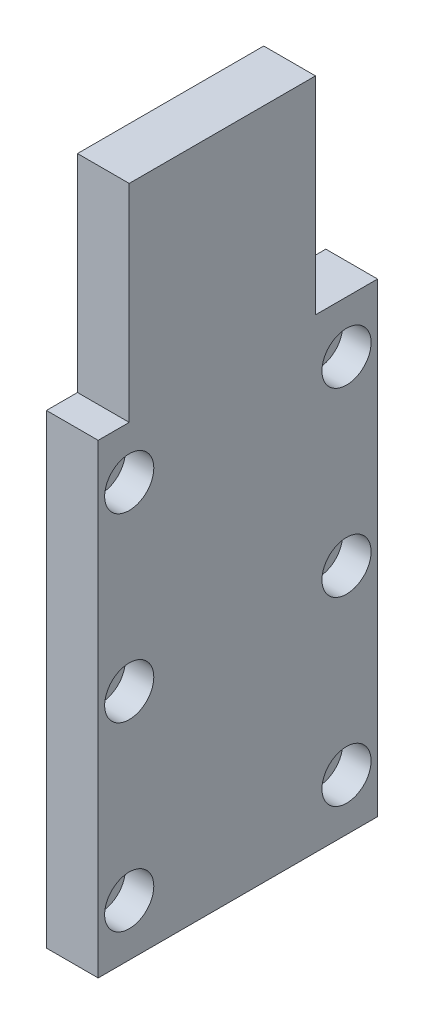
from build123d import *

# Parameters (mm, degrees)
SKETCH_1_W          = 10
SKETCH_1_H          = 130
EXTRUDE_1_DEPTH     = 54
SKETCH_2_OUTSIDE_W  = 84.224
SKETCH_2_OUTSIDE_H  = 160.224
SKETCH_2_OUTSIDE_R  = 2.75
CUT_EXTRUDE_1_DEPTH = 54
SKETCH_3_R          = 4.75
CUT_EXTRUDE_2_DEPTH = 5.5


with BuildPart() as part:
    # Sketch 1 → Extrude 1 (new body)
    with BuildSketch(Plane.XY):
        with Locations((5, 65)):
            Rectangle(SKETCH_1_W, SKETCH_1_H)
    extrude(amount=EXTRUDE_1_DEPTH)

    # Sketch 2 outside → Cut-Extrude 1 (cut)
    # profile 1 of 7: a face of its own
    with BuildSketch(Plane(origin=(10, 0, 0), x_dir=(0, 0, -1), z_dir=(1, 0, 0))):
        with Locations((-27, 65)):
            Rectangle(SKETCH_2_OUTSIDE_W, SKETCH_2_OUTSIDE_H)
        Polygon((-48, 130), (-12, 130), (-12, 90), (0, 90), (0, 0), (-54, 0), (-54, 90), (-48, 90), align=None, mode=Mode.SUBTRACT)
    # profile 2 of 7: a face of its own
    with BuildSketch(Plane(origin=(10, 0, 0), x_dir=(0, 0, -1), z_dir=(1, 0, 0))):
        with Locations((-48, 80)):
            Circle(SKETCH_2_OUTSIDE_R)
    # profile 3 of 7: a face of its own
    with BuildSketch(Plane(origin=(10, 0, 0), x_dir=(0, 0, -1), z_dir=(1, 0, 0))):
        with Locations((-6, 80)):
            Circle(SKETCH_2_OUTSIDE_R)
    # profile 4 of 7: a face of its own
    with BuildSketch(Plane(origin=(10, 0, 0), x_dir=(0, 0, -1), z_dir=(1, 0, 0))):
        with Locations((-48, 45)):
            Circle(SKETCH_2_OUTSIDE_R)
    # profile 5 of 7: a face of its own
    with BuildSketch(Plane(origin=(10, 0, 0), x_dir=(0, 0, -1), z_dir=(1, 0, 0))):
        with Locations((-6, 45)):
            Circle(SKETCH_2_OUTSIDE_R)
    # profile 6 of 7: a face of its own
    with BuildSketch(Plane(origin=(10, 0, 0), x_dir=(0, 0, -1), z_dir=(1, 0, 0))):
        with Locations((-6, 10)):
            Circle(SKETCH_2_OUTSIDE_R)
    # profile 7 of 7: a face of its own
    with BuildSketch(Plane(origin=(10, 0, 0), x_dir=(0, 0, -1), z_dir=(1, 0, 0))):
        with Locations((-48, 10)):
            Circle(SKETCH_2_OUTSIDE_R)
    extrude(amount=-CUT_EXTRUDE_1_DEPTH, mode=Mode.SUBTRACT)

    # Sketch 3 → Cut-Extrude 2 (cut)
    with BuildSketch(Plane(origin=(10, 0, 0), x_dir=(0, 0, -1), z_dir=(1, 0, 0))):
        with Locations((-48, 80)):
            Circle(SKETCH_3_R)
        with Locations((-6, 80)):
            Circle(SKETCH_3_R)
        with Locations((-48, 45)):
            Circle(SKETCH_3_R)
        with Locations((-6, 45)):
            Circle(SKETCH_3_R)
        with Locations((-6, 10)):
            Circle(SKETCH_3_R)
        with Locations((-48, 10)):
            Circle(SKETCH_3_R)
    extrude(amount=-CUT_EXTRUDE_2_DEPTH, mode=Mode.SUBTRACT)


solid = part.part
